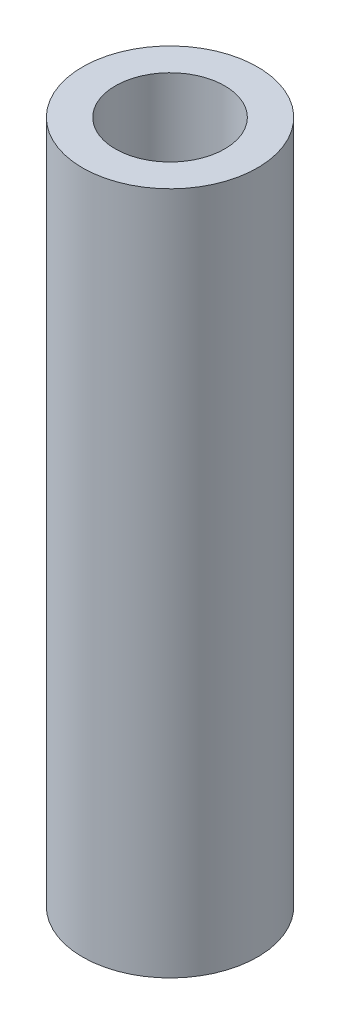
from build123d import *

# Parameters (mm, degrees)
SKETCH1_R           = 3.96875
SKETCH1_R_2         = 2.48125
BOSS_EXTRUDE1_DEPTH = 31


with BuildPart() as part:
    # Sketch1 → Boss-Extrude1 (new body)
    with BuildSketch(Plane(origin=(0, 0, 0), x_dir=(1, 0, 0), z_dir=(0, 1, 0))):
        with Locations(Location((0, 0, 0), (0, 0, 270))):
            Circle(SKETCH1_R)
        with Locations(Location((0, 0, 0), (0, 0, 270))):
            Circle(SKETCH1_R_2, mode=Mode.SUBTRACT)
    extrude(amount=BOSS_EXTRUDE1_DEPTH)


solid = part.part
